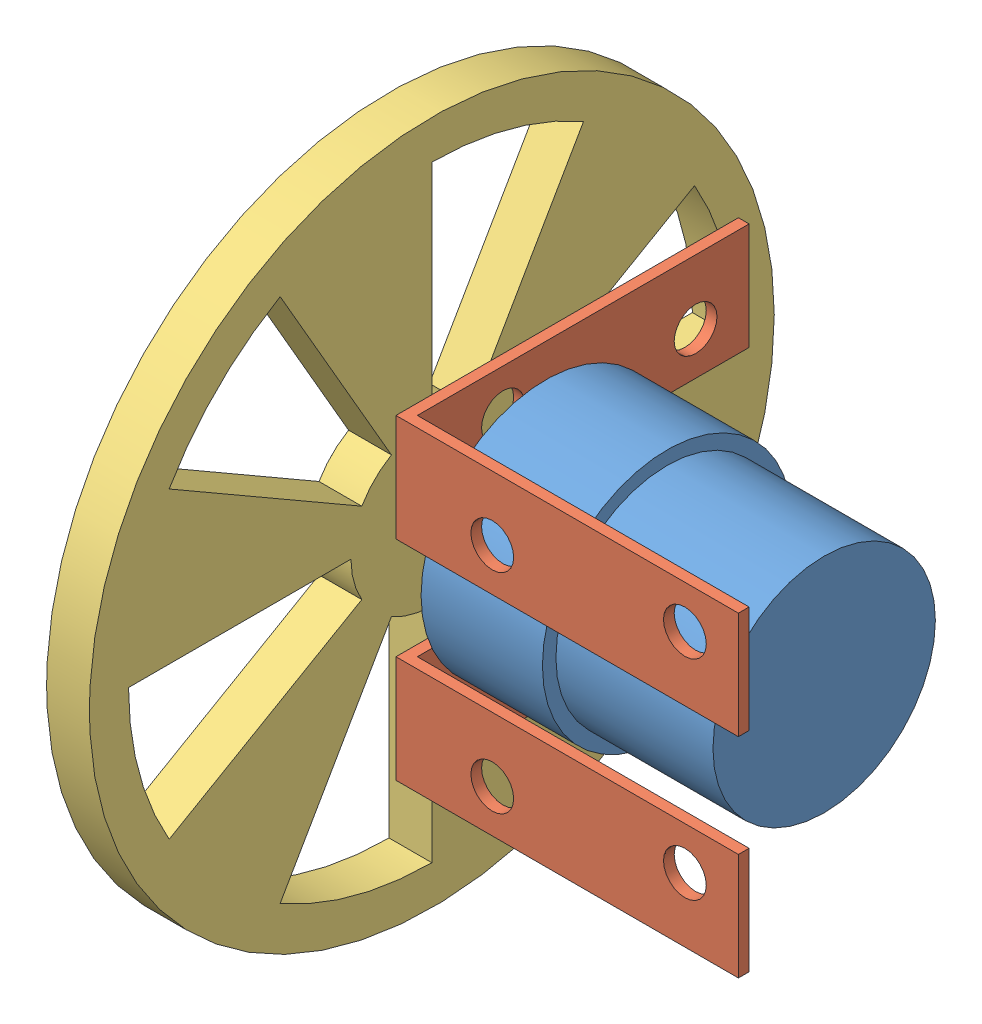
SolidWorks assembly roller wheel + hub + motor.SLDASM, configuration Default (file format 3800). Lengths in mm.
Overall size (71.81 101.6 101.6).
4 component instances, 3 part files, 8 mates.
Components (placement in the parent):
- dc motor - jameco_161382-1: dc motor - jameco_161382.SLDPRT [Default] at (-23.1125 8.981 -29.4197) x (0 0 1) z (-1 0 0) size (37 37 63.9)
- L channel _bracket style-1: L channel _bracket style.SLDPRT [Default] at (26.1 -14.4565 9.7178) size (50.8 15.88 50.8)
- L channel _bracket style-2: L channel _bracket style.SLDPRT [Default] at (26.1 16.5435 9.7178) size (50.8 15.88 50.8)
- acrylic wheel 4in diameter-1: acrylic wheel 4in diameter.SLDPRT [Default] at (-39.3625 8.981 -3.9197) x (0 -1 0) z (0 0 1) size (101.6 6.35 101.6)
Mates (geometry in assembly coordinates):
- Concentric7: concentric: cylinder of dc motor - jameco_161382-1; cylinder of L channel _bracket style-1
- Coincident3: coincident: plane of dc motor - jameco_161382-1 through (-23.1125 8.981 -10.9197) normal (-1 0 0); plane of L channel _bracket style-1 through (-23.1125 1.4185 -41.0822) normal (1 0 0)
- Concentric8: concentric: cylinder of dc motor - jameco_161382-1; cylinder of L channel _bracket style-2
- Coincident4: coincident: plane of dc motor - jameco_161382-1 through (-23.1125 8.981 -10.9197) normal (-1 0 0); plane of L channel _bracket style-2 through (-23.1125 32.4185 -41.0822) normal (1 0 0)
- Parallel1: parallel aligned: plane of L channel _bracket style-1 through (26.1 1.4185 9.7178) normal (0 0 1); plane of L channel _bracket style-2 through (26.1 32.4185 9.7178) normal (0 0 1)
- Coincident5: coincident aligned: plane of L channel _bracket style-1 through (26.1 1.4185 9.7178) normal (0 0 1); plane of L channel _bracket style-2 through (26.1 32.4185 9.7178) normal (0 0 1)
- Concentric9: concentric: cylinder of dc motor - jameco_161382-1; cylinder of ?
- Distance1: distance = 12.7 mm anti-aligned: plane of acrylic wheel 4in diameter-1 through (-33.0125 8.981 -3.9197) normal (1 0 0); plane of dc motor - jameco_161382-1 through (-45.7125 8.981 -3.9197) normal (-1 0 0)
